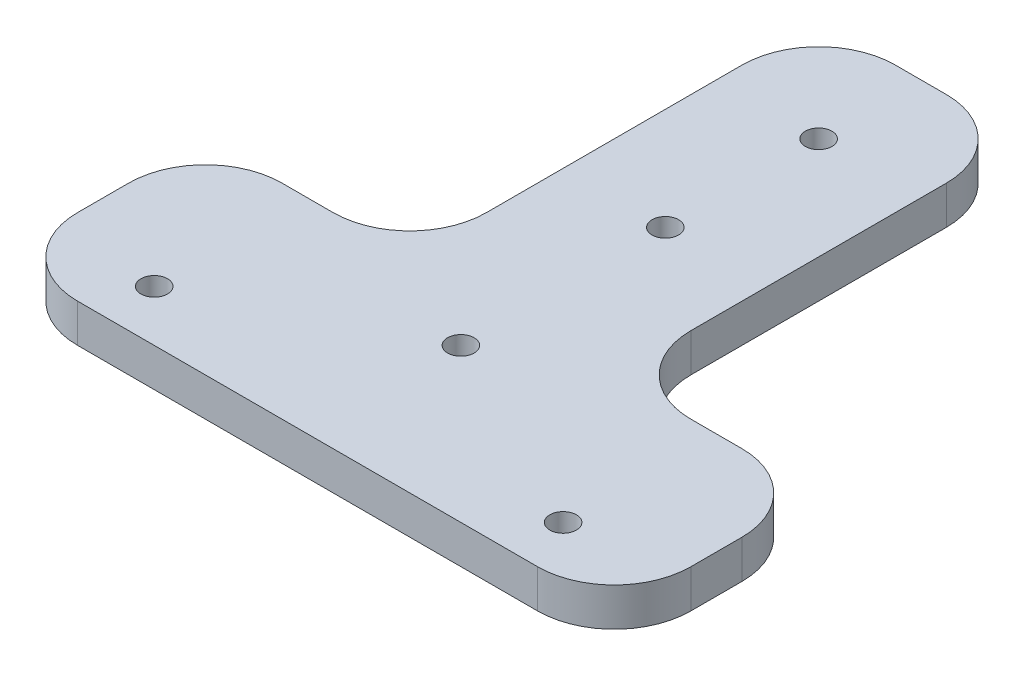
ISO-10303-21;
HEADER;
FILE_DESCRIPTION(('STEP AP214'),'2;1');
FILE_NAME('part.step','',(''),(''),'','','');
FILE_SCHEMA(('AUTOMOTIVE_DESIGN { 1 0 10303 214 1 1 1 1 }'));
ENDSEC;
DATA;
#1=APPLICATION_CONTEXT('core data for automotive mechanical design processes');
#2=APPLICATION_PROTOCOL_DEFINITION('international standard','automotive_design',2000,#1);
#3=PRODUCT_CONTEXT('',#1,'mechanical');
#4=PRODUCT('Part','Part','',(#3));
#5=PRODUCT_RELATED_PRODUCT_CATEGORY('part','',(#4));
#6=PRODUCT_DEFINITION_FORMATION('','',#4);
#7=PRODUCT_DEFINITION_CONTEXT('part definition',#1,'design');
#8=PRODUCT_DEFINITION('design','',#6,#7);
#9=PRODUCT_DEFINITION_SHAPE('','',#8);
#10=(LENGTH_UNIT() NAMED_UNIT(*) SI_UNIT(.MILLI.,.METRE.));
#11=(NAMED_UNIT(*) PLANE_ANGLE_UNIT() SI_UNIT($,.RADIAN.));
#12=(NAMED_UNIT(*) SI_UNIT($,.STERADIAN.) SOLID_ANGLE_UNIT());
#13=UNCERTAINTY_MEASURE_WITH_UNIT(LENGTH_MEASURE(1.E-05),#10,'distance_accuracy_value','');
#14=(GEOMETRIC_REPRESENTATION_CONTEXT(3) GLOBAL_UNCERTAINTY_ASSIGNED_CONTEXT((#13)) GLOBAL_UNIT_ASSIGNED_CONTEXT((#10,
#11,#12)) REPRESENTATION_CONTEXT('',''));
#15=CARTESIAN_POINT('',(0.,0.,0.));
#16=DIRECTION('',(0.,0.,1.));
#17=DIRECTION('',(1.,0.,0.));
#18=AXIS2_PLACEMENT_3D('',#15,#16,#17);
#19=CARTESIAN_POINT('',(0.,9.525,0.));
#20=DIRECTION('',(0.,0.,-1.));
#21=DIRECTION('',(-1.,0.,0.));
#22=AXIS2_PLACEMENT_3D('',#19,#20,#21);
#23=PLANE('',#22);
#24=DIRECTION('',(1.,0.,0.));
#25=VECTOR('',#24,1.);
#26=CARTESIAN_POINT('',(0.,0.,0.));
#27=LINE('',#26,#25);
#28=CARTESIAN_POINT('',(-57.15,0.,0.));
#29=VERTEX_POINT('',#28);
#30=CARTESIAN_POINT('',(57.15,0.,0.));
#31=VERTEX_POINT('',#30);
#32=EDGE_CURVE('E173',#29,#31,#27,.T.);
#33=ORIENTED_EDGE('',*,*,#32,.T.);
#34=DIRECTION('',(0.,-1.,0.));
#35=VECTOR('',#34,1.);
#36=CARTESIAN_POINT('',(57.15,9.525,0.));
#37=LINE('',#36,#35);
#38=CARTESIAN_POINT('',(57.15,9.525,0.));
#39=VERTEX_POINT('',#38);
#40=EDGE_CURVE('E151',#31,#39,#37,.F.);
#41=ORIENTED_EDGE('',*,*,#40,.T.);
#42=DIRECTION('',(1.,0.,0.));
#43=VECTOR('',#42,1.);
#44=CARTESIAN_POINT('',(0.,9.525,0.));
#45=LINE('',#44,#43);
#46=CARTESIAN_POINT('',(-57.15,9.525,0.));
#47=VERTEX_POINT('',#46);
#48=EDGE_CURVE('E195',#47,#39,#45,.T.);
#49=ORIENTED_EDGE('',*,*,#48,.F.);
#50=DIRECTION('',(0.,-1.,0.));
#51=VECTOR('',#50,1.);
#52=CARTESIAN_POINT('',(-57.15,9.525,0.));
#53=LINE('',#52,#51);
#54=EDGE_CURVE('E156',#47,#29,#53,.T.);
#55=ORIENTED_EDGE('',*,*,#54,.T.);
#56=EDGE_LOOP('',(#33,#41,#49,#55));
#57=FACE_BOUND('',#56,.T.);
#58=ADVANCED_FACE('F32',(#57),#23,.F.);
#59=CARTESIAN_POINT('',(76.2,9.525,-50.8));
#60=DIRECTION('',(-1.,0.,0.));
#61=DIRECTION('',(0.,0.,1.));
#62=AXIS2_PLACEMENT_3D('',#59,#60,#61);
#63=PLANE('',#62);
#64=DIRECTION('',(0.,0.,-1.));
#65=VECTOR('',#64,1.);
#66=CARTESIAN_POINT('',(76.2,9.525,-50.8));
#67=LINE('',#66,#65);
#68=CARTESIAN_POINT('',(76.2,9.525,-19.05));
#69=VERTEX_POINT('',#68);
#70=CARTESIAN_POINT('',(76.2,9.525,-31.75));
#71=VERTEX_POINT('',#70);
#72=EDGE_CURVE('E166',#69,#71,#67,.T.);
#73=ORIENTED_EDGE('',*,*,#72,.F.);
#74=DIRECTION('',(0.,-1.,0.));
#75=VECTOR('',#74,1.);
#76=CARTESIAN_POINT('',(76.2,9.525,-19.05));
#77=LINE('',#76,#75);
#78=CARTESIAN_POINT('',(76.2,0.,-19.05));
#79=VERTEX_POINT('',#78);
#80=EDGE_CURVE('E150',#69,#79,#77,.T.);
#81=ORIENTED_EDGE('',*,*,#80,.T.);
#82=DIRECTION('',(0.,0.,-1.));
#83=VECTOR('',#82,1.);
#84=CARTESIAN_POINT('',(76.2,0.,-50.8));
#85=LINE('',#84,#83);
#86=CARTESIAN_POINT('',(76.2,0.,-31.75));
#87=VERTEX_POINT('',#86);
#88=EDGE_CURVE('E163',#79,#87,#85,.T.);
#89=ORIENTED_EDGE('',*,*,#88,.T.);
#90=DIRECTION('',(0.,-1.,0.));
#91=VECTOR('',#90,1.);
#92=CARTESIAN_POINT('',(76.2,9.525,-31.75));
#93=LINE('',#92,#91);
#94=EDGE_CURVE('E168',#87,#71,#93,.F.);
#95=ORIENTED_EDGE('',*,*,#94,.T.);
#96=EDGE_LOOP('',(#73,#81,#89,#95));
#97=FACE_BOUND('',#96,.T.);
#98=ADVANCED_FACE('F162',(#97),#63,.F.);
#99=CARTESIAN_POINT('',(25.4,9.525,-50.8));
#100=DIRECTION('',(0.,0.,1.));
#101=DIRECTION('',(1.,0.,0.));
#102=AXIS2_PLACEMENT_3D('',#99,#100,#101);
#103=PLANE('',#102);
#104=DIRECTION('',(-1.,0.,0.));
#105=VECTOR('',#104,1.);
#106=CARTESIAN_POINT('',(25.4,9.525,-50.8));
#107=LINE('',#106,#105);
#108=CARTESIAN_POINT('',(57.15,9.525,-50.8));
#109=VERTEX_POINT('',#108);
#110=CARTESIAN_POINT('',(44.45,9.525,-50.8));
#111=VERTEX_POINT('',#110);
#112=EDGE_CURVE('E281',#109,#111,#107,.T.);
#113=ORIENTED_EDGE('',*,*,#112,.F.);
#114=DIRECTION('',(0.,-1.,0.));
#115=VECTOR('',#114,1.);
#116=CARTESIAN_POINT('',(57.15,9.525,-50.8));
#117=LINE('',#116,#115);
#118=CARTESIAN_POINT('',(57.15,0.,-50.8));
#119=VERTEX_POINT('',#118);
#120=EDGE_CURVE('E222',#109,#119,#117,.T.);
#121=ORIENTED_EDGE('',*,*,#120,.T.);
#122=DIRECTION('',(-1.,0.,0.));
#123=VECTOR('',#122,1.);
#124=CARTESIAN_POINT('',(25.4,0.,-50.8));
#125=LINE('',#124,#123);
#126=CARTESIAN_POINT('',(44.45,0.,-50.8));
#127=VERTEX_POINT('',#126);
#128=EDGE_CURVE('E172',#119,#127,#125,.T.);
#129=ORIENTED_EDGE('',*,*,#128,.T.);
#130=DIRECTION('',(0.,-1.,0.));
#131=VECTOR('',#130,1.);
#132=CARTESIAN_POINT('',(44.45,9.525,-50.8));
#133=LINE('',#132,#131);
#134=EDGE_CURVE('E220',#127,#111,#133,.F.);
#135=ORIENTED_EDGE('',*,*,#134,.T.);
#136=EDGE_LOOP('',(#113,#121,#129,#135));
#137=FACE_BOUND('',#136,.T.);
#138=ADVANCED_FACE('F357',(#137),#103,.F.);
#139=CARTESIAN_POINT('',(25.4,9.525,-152.4));
#140=DIRECTION('',(-1.,0.,0.));
#141=DIRECTION('',(0.,0.,1.));
#142=AXIS2_PLACEMENT_3D('',#139,#140,#141);
#143=PLANE('',#142);
#144=DIRECTION('',(0.,0.,-1.));
#145=VECTOR('',#144,1.);
#146=CARTESIAN_POINT('',(25.4,9.525,-152.4));
#147=LINE('',#146,#145);
#148=CARTESIAN_POINT('',(25.4,9.525,-69.85));
#149=VERTEX_POINT('',#148);
#150=CARTESIAN_POINT('',(25.4,9.525,-133.35));
#151=VERTEX_POINT('',#150);
#152=EDGE_CURVE('E278',#149,#151,#147,.T.);
#153=ORIENTED_EDGE('',*,*,#152,.F.);
#154=DIRECTION('',(0.,-1.,0.));
#155=VECTOR('',#154,1.);
#156=CARTESIAN_POINT('',(25.4,0.,-69.85));
#157=LINE('',#156,#155);
#158=CARTESIAN_POINT('',(25.4,0.,-69.85));
#159=VERTEX_POINT('',#158);
#160=EDGE_CURVE('E227',#149,#159,#157,.T.);
#161=ORIENTED_EDGE('',*,*,#160,.T.);
#162=DIRECTION('',(0.,0.,-1.));
#163=VECTOR('',#162,1.);
#164=CARTESIAN_POINT('',(25.4,0.,-152.4));
#165=LINE('',#164,#163);
#166=CARTESIAN_POINT('',(25.4,0.,-133.35));
#167=VERTEX_POINT('',#166);
#168=EDGE_CURVE('E176',#159,#167,#165,.T.);
#169=ORIENTED_EDGE('',*,*,#168,.T.);
#170=DIRECTION('',(0.,-1.,0.));
#171=VECTOR('',#170,1.);
#172=CARTESIAN_POINT('',(25.4,9.525,-133.35));
#173=LINE('',#172,#171);
#174=EDGE_CURVE('E225',#167,#151,#173,.F.);
#175=ORIENTED_EDGE('',*,*,#174,.T.);
#176=EDGE_LOOP('',(#153,#161,#169,#175));
#177=FACE_BOUND('',#176,.T.);
#178=ADVANCED_FACE('F399',(#177),#143,.F.);
#179=CARTESIAN_POINT('',(-25.4,9.525,-152.4));
#180=DIRECTION('',(0.,0.,1.));
#181=DIRECTION('',(1.,0.,0.));
#182=AXIS2_PLACEMENT_3D('',#179,#180,#181);
#183=PLANE('',#182);
#184=DIRECTION('',(-1.,0.,0.));
#185=VECTOR('',#184,1.);
#186=CARTESIAN_POINT('',(-25.4,9.525,-152.4));
#187=LINE('',#186,#185);
#188=CARTESIAN_POINT('',(6.34999999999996,9.525,-152.4));
#189=VERTEX_POINT('',#188);
#190=CARTESIAN_POINT('',(-6.35000000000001,9.525,-152.4));
#191=VERTEX_POINT('',#190);
#192=EDGE_CURVE('E273',#189,#191,#187,.T.);
#193=ORIENTED_EDGE('',*,*,#192,.F.);
#194=DIRECTION('',(0.,-1.,0.));
#195=VECTOR('',#194,1.);
#196=CARTESIAN_POINT('',(6.34999999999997,9.525,-152.4));
#197=LINE('',#196,#195);
#198=CARTESIAN_POINT('',(6.34999999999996,0.,-152.4));
#199=VERTEX_POINT('',#198);
#200=EDGE_CURVE('E246',#189,#199,#197,.T.);
#201=ORIENTED_EDGE('',*,*,#200,.T.);
#202=DIRECTION('',(-1.,0.,0.));
#203=VECTOR('',#202,1.);
#204=CARTESIAN_POINT('',(-25.4,0.,-152.4));
#205=LINE('',#204,#203);
#206=CARTESIAN_POINT('',(-6.35000000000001,0.,-152.4));
#207=VERTEX_POINT('',#206);
#208=EDGE_CURVE('E184',#199,#207,#205,.T.);
#209=ORIENTED_EDGE('',*,*,#208,.T.);
#210=DIRECTION('',(0.,-1.,0.));
#211=VECTOR('',#210,1.);
#212=CARTESIAN_POINT('',(-6.35,9.525,-152.4));
#213=LINE('',#212,#211);
#214=EDGE_CURVE('E244',#207,#191,#213,.F.);
#215=ORIENTED_EDGE('',*,*,#214,.T.);
#216=EDGE_LOOP('',(#193,#201,#209,#215));
#217=FACE_BOUND('',#216,.T.);
#218=ADVANCED_FACE('F394',(#217),#183,.F.);
#219=CARTESIAN_POINT('',(-25.4,9.525,-50.8));
#220=DIRECTION('',(1.,0.,0.));
#221=DIRECTION('',(0.,0.,-1.));
#222=AXIS2_PLACEMENT_3D('',#219,#220,#221);
#223=PLANE('',#222);
#224=DIRECTION('',(0.,0.,1.));
#225=VECTOR('',#224,1.);
#226=CARTESIAN_POINT('',(-25.4,0.,-50.8));
#227=LINE('',#226,#225);
#228=CARTESIAN_POINT('',(-25.4,0.,-133.35));
#229=VERTEX_POINT('',#228);
#230=CARTESIAN_POINT('',(-25.4,0.,-69.85));
#231=VERTEX_POINT('',#230);
#232=EDGE_CURVE('E187',#229,#231,#227,.T.);
#233=ORIENTED_EDGE('',*,*,#232,.T.);
#234=DIRECTION('',(0.,-1.,0.));
#235=VECTOR('',#234,1.);
#236=CARTESIAN_POINT('',(-25.4,9.525,-69.85));
#237=LINE('',#236,#235);
#238=CARTESIAN_POINT('',(-25.4,9.525,-69.85));
#239=VERTEX_POINT('',#238);
#240=EDGE_CURVE('E242',#231,#239,#237,.F.);
#241=ORIENTED_EDGE('',*,*,#240,.T.);
#242=DIRECTION('',(0.,0.,1.));
#243=VECTOR('',#242,1.);
#244=CARTESIAN_POINT('',(-25.4,9.525,-50.8));
#245=LINE('',#244,#243);
#246=CARTESIAN_POINT('',(-25.4,9.525,-133.35));
#247=VERTEX_POINT('',#246);
#248=EDGE_CURVE('E268',#247,#239,#245,.T.);
#249=ORIENTED_EDGE('',*,*,#248,.F.);
#250=DIRECTION('',(0.,-1.,0.));
#251=VECTOR('',#250,1.);
#252=CARTESIAN_POINT('',(-25.4,9.525,-133.35));
#253=LINE('',#252,#251);
#254=EDGE_CURVE('E239',#247,#229,#253,.T.);
#255=ORIENTED_EDGE('',*,*,#254,.T.);
#256=EDGE_LOOP('',(#233,#241,#249,#255));
#257=FACE_BOUND('',#256,.T.);
#258=ADVANCED_FACE('F258',(#257),#223,.F.);
#259=CARTESIAN_POINT('',(-76.2,9.525,-50.8));
#260=DIRECTION('',(0.,0.,1.));
#261=DIRECTION('',(1.,0.,0.));
#262=AXIS2_PLACEMENT_3D('',#259,#260,#261);
#263=PLANE('',#262);
#264=DIRECTION('',(-1.,0.,0.));
#265=VECTOR('',#264,1.);
#266=CARTESIAN_POINT('',(-76.2,0.,-50.8));
#267=LINE('',#266,#265);
#268=CARTESIAN_POINT('',(-44.45,0.,-50.8));
#269=VERTEX_POINT('',#268);
#270=CARTESIAN_POINT('',(-57.15,0.,-50.8));
#271=VERTEX_POINT('',#270);
#272=EDGE_CURVE('E190',#269,#271,#267,.T.);
#273=ORIENTED_EDGE('',*,*,#272,.T.);
#274=DIRECTION('',(0.,-1.,0.));
#275=VECTOR('',#274,1.);
#276=CARTESIAN_POINT('',(-57.15,9.525,-50.8));
#277=LINE('',#276,#275);
#278=CARTESIAN_POINT('',(-57.15,9.525,-50.8));
#279=VERTEX_POINT('',#278);
#280=EDGE_CURVE('E237',#271,#279,#277,.F.);
#281=ORIENTED_EDGE('',*,*,#280,.T.);
#282=DIRECTION('',(-1.,0.,0.));
#283=VECTOR('',#282,1.);
#284=CARTESIAN_POINT('',(-76.2,9.525,-50.8));
#285=LINE('',#284,#283);
#286=CARTESIAN_POINT('',(-44.45,9.525,-50.8));
#287=VERTEX_POINT('',#286);
#288=EDGE_CURVE('E267',#287,#279,#285,.T.);
#289=ORIENTED_EDGE('',*,*,#288,.F.);
#290=DIRECTION('',(0.,-1.,0.));
#291=VECTOR('',#290,1.);
#292=CARTESIAN_POINT('',(-44.45,0.,-50.8));
#293=LINE('',#292,#291);
#294=EDGE_CURVE('E234',#287,#269,#293,.T.);
#295=ORIENTED_EDGE('',*,*,#294,.T.);
#296=EDGE_LOOP('',(#273,#281,#289,#295));
#297=FACE_BOUND('',#296,.T.);
#298=ADVANCED_FACE('F270',(#297),#263,.F.);
#299=CARTESIAN_POINT('',(-76.2,9.525,0.));
#300=DIRECTION('',(1.,0.,0.));
#301=DIRECTION('',(0.,0.,-1.));
#302=AXIS2_PLACEMENT_3D('',#299,#300,#301);
#303=PLANE('',#302);
#304=DIRECTION('',(0.,0.,1.));
#305=VECTOR('',#304,1.);
#306=CARTESIAN_POINT('',(-76.2,0.,0.));
#307=LINE('',#306,#305);
#308=CARTESIAN_POINT('',(-76.2,0.,-31.75));
#309=VERTEX_POINT('',#308);
#310=CARTESIAN_POINT('',(-76.2,0.,-19.05));
#311=VERTEX_POINT('',#310);
#312=EDGE_CURVE('E193',#309,#311,#307,.T.);
#313=ORIENTED_EDGE('',*,*,#312,.T.);
#314=DIRECTION('',(0.,-1.,0.));
#315=VECTOR('',#314,1.);
#316=CARTESIAN_POINT('',(-76.2,9.525,-19.05));
#317=LINE('',#316,#315);
#318=CARTESIAN_POINT('',(-76.2,9.525,-19.05));
#319=VERTEX_POINT('',#318);
#320=EDGE_CURVE('E47',#311,#319,#317,.F.);
#321=ORIENTED_EDGE('',*,*,#320,.T.);
#322=DIRECTION('',(0.,0.,1.));
#323=VECTOR('',#322,1.);
#324=CARTESIAN_POINT('',(-76.2,9.525,0.));
#325=LINE('',#324,#323);
#326=CARTESIAN_POINT('',(-76.2,9.525,-31.75));
#327=VERTEX_POINT('',#326);
#328=EDGE_CURVE('E196',#327,#319,#325,.T.);
#329=ORIENTED_EDGE('',*,*,#328,.F.);
#330=DIRECTION('',(0.,-1.,0.));
#331=VECTOR('',#330,1.);
#332=CARTESIAN_POINT('',(-76.2,9.525,-31.75));
#333=LINE('',#332,#331);
#334=EDGE_CURVE('E230',#327,#309,#333,.T.);
#335=ORIENTED_EDGE('',*,*,#334,.T.);
#336=EDGE_LOOP('',(#313,#321,#329,#335));
#337=FACE_BOUND('',#336,.T.);
#338=ADVANCED_FACE('F327',(#337),#303,.F.);
#339=CARTESIAN_POINT('',(-76.2,9.525,0.));
#340=DIRECTION('',(0.,-1.,0.));
#341=DIRECTION('',(0.,0.,-1.));
#342=AXIS2_PLACEMENT_3D('',#339,#340,#341);
#343=PLANE('',#342);
#344=CARTESIAN_POINT('',(50.8,9.525,-12.7));
#345=DIRECTION('',(0.,1.,0.));
#346=DIRECTION('',(0.,0.,1.));
#347=AXIS2_PLACEMENT_3D('',#344,#345,#346);
#348=CIRCLE('',#347,3.302);
#349=CARTESIAN_POINT('',(50.8,9.525,-9.39799999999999));
#350=VERTEX_POINT('',#349);
#351=EDGE_CURVE('E310',#350,#350,#348,.T.);
#352=ORIENTED_EDGE('',*,*,#351,.F.);
#353=EDGE_LOOP('',(#352));
#354=FACE_BOUND('',#353,.T.);
#355=CARTESIAN_POINT('',(0.,9.525,-38.1));
#356=DIRECTION('',(0.,1.,0.));
#357=DIRECTION('',(0.,0.,1.));
#358=AXIS2_PLACEMENT_3D('',#355,#356,#357);
#359=CIRCLE('',#358,3.302);
#360=CARTESIAN_POINT('',(0.,9.525,-34.798));
#361=VERTEX_POINT('',#360);
#362=EDGE_CURVE('E304',#361,#361,#359,.T.);
#363=ORIENTED_EDGE('',*,*,#362,.F.);
#364=EDGE_LOOP('',(#363));
#365=FACE_BOUND('',#364,.T.);
#366=CARTESIAN_POINT('',(-50.8,9.525,-12.7));
#367=DIRECTION('',(0.,1.,0.));
#368=DIRECTION('',(0.,0.,1.));
#369=AXIS2_PLACEMENT_3D('',#366,#367,#368);
#370=CIRCLE('',#369,3.302);
#371=CARTESIAN_POINT('',(-50.8,9.525,-9.39799999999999));
#372=VERTEX_POINT('',#371);
#373=EDGE_CURVE('E298',#372,#372,#370,.T.);
#374=ORIENTED_EDGE('',*,*,#373,.F.);
#375=EDGE_LOOP('',(#374));
#376=FACE_BOUND('',#375,.T.);
#377=CARTESIAN_POINT('',(0.,9.525,-88.9));
#378=DIRECTION('',(0.,1.,0.));
#379=DIRECTION('',(0.,0.,1.));
#380=AXIS2_PLACEMENT_3D('',#377,#378,#379);
#381=CIRCLE('',#380,3.30199999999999);
#382=CARTESIAN_POINT('',(0.,9.525,-85.598));
#383=VERTEX_POINT('',#382);
#384=EDGE_CURVE('E292',#383,#383,#381,.T.);
#385=ORIENTED_EDGE('',*,*,#384,.F.);
#386=EDGE_LOOP('',(#385));
#387=FACE_BOUND('',#386,.T.);
#388=CARTESIAN_POINT('',(0.,9.525,-127.));
#389=DIRECTION('',(0.,1.,0.));
#390=DIRECTION('',(0.,0.,1.));
#391=AXIS2_PLACEMENT_3D('',#388,#389,#390);
#392=CIRCLE('',#391,3.30199999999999);
#393=CARTESIAN_POINT('',(0.,9.525,-123.698));
#394=VERTEX_POINT('',#393);
#395=EDGE_CURVE('E286',#394,#394,#392,.T.);
#396=ORIENTED_EDGE('',*,*,#395,.F.);
#397=EDGE_LOOP('',(#396));
#398=FACE_BOUND('',#397,.T.);
#399=ORIENTED_EDGE('',*,*,#48,.T.);
#400=CARTESIAN_POINT('',(57.15,9.525,-19.05));
#401=DIRECTION('',(0.,-1.,0.));
#402=DIRECTION('',(0.,0.,-1.));
#403=AXIS2_PLACEMENT_3D('',#400,#401,#402);
#404=CIRCLE('',#403,19.05);
#405=EDGE_CURVE('E218',#39,#69,#404,.F.);
#406=ORIENTED_EDGE('',*,*,#405,.T.);
#407=ORIENTED_EDGE('',*,*,#72,.T.);
#408=CARTESIAN_POINT('',(57.15,9.525,-31.75));
#409=DIRECTION('',(0.,-1.,0.));
#410=DIRECTION('',(0.,0.,-1.));
#411=AXIS2_PLACEMENT_3D('',#408,#409,#410);
#412=CIRCLE('',#411,19.05);
#413=EDGE_CURVE('E216',#71,#109,#412,.F.);
#414=ORIENTED_EDGE('',*,*,#413,.T.);
#415=ORIENTED_EDGE('',*,*,#112,.T.);
#416=CARTESIAN_POINT('',(44.45,9.525,-69.85));
#417=DIRECTION('',(0.,-1.,0.));
#418=DIRECTION('',(0.,0.,-1.));
#419=AXIS2_PLACEMENT_3D('',#416,#417,#418);
#420=CIRCLE('',#419,19.05);
#421=EDGE_CURVE('E251',#111,#149,#420,.T.);
#422=ORIENTED_EDGE('',*,*,#421,.T.);
#423=ORIENTED_EDGE('',*,*,#152,.T.);
#424=CARTESIAN_POINT('',(6.34999999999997,9.525,-133.35));
#425=DIRECTION('',(0.,-1.,0.));
#426=DIRECTION('',(0.,0.,-1.));
#427=AXIS2_PLACEMENT_3D('',#424,#425,#426);
#428=CIRCLE('',#427,19.05);
#429=EDGE_CURVE('E211',#151,#189,#428,.F.);
#430=ORIENTED_EDGE('',*,*,#429,.T.);
#431=ORIENTED_EDGE('',*,*,#192,.T.);
#432=CARTESIAN_POINT('',(-6.35,9.525,-133.35));
#433=DIRECTION('',(0.,-1.,0.));
#434=DIRECTION('',(0.,0.,-1.));
#435=AXIS2_PLACEMENT_3D('',#432,#433,#434);
#436=CIRCLE('',#435,19.05);
#437=EDGE_CURVE('E209',#191,#247,#436,.F.);
#438=ORIENTED_EDGE('',*,*,#437,.T.);
#439=ORIENTED_EDGE('',*,*,#248,.T.);
#440=CARTESIAN_POINT('',(-44.45,9.525,-69.85));
#441=DIRECTION('',(0.,-1.,0.));
#442=DIRECTION('',(0.,0.,-1.));
#443=AXIS2_PLACEMENT_3D('',#440,#441,#442);
#444=CIRCLE('',#443,19.05);
#445=EDGE_CURVE('E11',#239,#287,#444,.T.);
#446=ORIENTED_EDGE('',*,*,#445,.T.);
#447=ORIENTED_EDGE('',*,*,#288,.T.);
#448=CARTESIAN_POINT('',(-57.15,9.525,-31.75));
#449=DIRECTION('',(0.,-1.,0.));
#450=DIRECTION('',(0.,0.,-1.));
#451=AXIS2_PLACEMENT_3D('',#448,#449,#450);
#452=CIRCLE('',#451,19.05);
#453=EDGE_CURVE('E54',#279,#327,#452,.F.);
#454=ORIENTED_EDGE('',*,*,#453,.T.);
#455=ORIENTED_EDGE('',*,*,#328,.T.);
#456=CARTESIAN_POINT('',(-57.15,9.525,-19.05));
#457=DIRECTION('',(0.,-1.,0.));
#458=DIRECTION('',(0.,0.,-1.));
#459=AXIS2_PLACEMENT_3D('',#456,#457,#458);
#460=CIRCLE('',#459,19.05);
#461=EDGE_CURVE('E214',#319,#47,#460,.F.);
#462=ORIENTED_EDGE('',*,*,#461,.T.);
#463=EDGE_LOOP('',(#399,#406,#407,#414,#415,#422,#423,#430,#431,#438,#439,#446,#447,#454,#455,#462));
#464=FACE_BOUND('',#463,.T.);
#465=ADVANCED_FACE('F266',(#354,#365,#376,#387,#398,#464),#343,.F.);
#466=CARTESIAN_POINT('',(-76.2,0.,0.));
#467=DIRECTION('',(0.,-1.,0.));
#468=DIRECTION('',(0.,0.,-1.));
#469=AXIS2_PLACEMENT_3D('',#466,#467,#468);
#470=PLANE('',#469);
#471=CARTESIAN_POINT('',(50.8,0.,-12.7));
#472=DIRECTION('',(0.,1.,0.));
#473=DIRECTION('',(0.,0.,1.));
#474=AXIS2_PLACEMENT_3D('',#471,#472,#473);
#475=CIRCLE('',#474,3.302);
#476=CARTESIAN_POINT('',(50.8,0.,-9.39799999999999));
#477=VERTEX_POINT('',#476);
#478=EDGE_CURVE('E307',#477,#477,#475,.T.);
#479=ORIENTED_EDGE('',*,*,#478,.T.);
#480=EDGE_LOOP('',(#479));
#481=FACE_BOUND('',#480,.T.);
#482=CARTESIAN_POINT('',(0.,0.,-38.1));
#483=DIRECTION('',(0.,1.,0.));
#484=DIRECTION('',(0.,0.,1.));
#485=AXIS2_PLACEMENT_3D('',#482,#483,#484);
#486=CIRCLE('',#485,3.302);
#487=CARTESIAN_POINT('',(0.,0.,-34.798));
#488=VERTEX_POINT('',#487);
#489=EDGE_CURVE('E301',#488,#488,#486,.T.);
#490=ORIENTED_EDGE('',*,*,#489,.T.);
#491=EDGE_LOOP('',(#490));
#492=FACE_BOUND('',#491,.T.);
#493=CARTESIAN_POINT('',(-50.8,0.,-12.7));
#494=DIRECTION('',(0.,1.,0.));
#495=DIRECTION('',(0.,0.,1.));
#496=AXIS2_PLACEMENT_3D('',#493,#494,#495);
#497=CIRCLE('',#496,3.302);
#498=CARTESIAN_POINT('',(-50.8,0.,-9.39799999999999));
#499=VERTEX_POINT('',#498);
#500=EDGE_CURVE('E295',#499,#499,#497,.T.);
#501=ORIENTED_EDGE('',*,*,#500,.T.);
#502=EDGE_LOOP('',(#501));
#503=FACE_BOUND('',#502,.T.);
#504=CARTESIAN_POINT('',(0.,0.,-88.9));
#505=DIRECTION('',(0.,1.,0.));
#506=DIRECTION('',(0.,0.,1.));
#507=AXIS2_PLACEMENT_3D('',#504,#505,#506);
#508=CIRCLE('',#507,3.30199999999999);
#509=CARTESIAN_POINT('',(0.,0.,-85.598));
#510=VERTEX_POINT('',#509);
#511=EDGE_CURVE('E289',#510,#510,#508,.T.);
#512=ORIENTED_EDGE('',*,*,#511,.T.);
#513=EDGE_LOOP('',(#512));
#514=FACE_BOUND('',#513,.T.);
#515=CARTESIAN_POINT('',(0.,0.,-127.));
#516=DIRECTION('',(0.,1.,0.));
#517=DIRECTION('',(0.,0.,1.));
#518=AXIS2_PLACEMENT_3D('',#515,#516,#517);
#519=CIRCLE('',#518,3.30199999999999);
#520=CARTESIAN_POINT('',(0.,0.,-123.698));
#521=VERTEX_POINT('',#520);
#522=EDGE_CURVE('E178',#521,#521,#519,.T.);
#523=ORIENTED_EDGE('',*,*,#522,.T.);
#524=EDGE_LOOP('',(#523));
#525=FACE_BOUND('',#524,.T.);
#526=ORIENTED_EDGE('',*,*,#88,.F.);
#527=CARTESIAN_POINT('',(57.15,0.,-19.05));
#528=DIRECTION('',(0.,-1.,0.));
#529=DIRECTION('',(0.,0.,-1.));
#530=AXIS2_PLACEMENT_3D('',#527,#528,#529);
#531=CIRCLE('',#530,19.05);
#532=EDGE_CURVE('E146',#79,#31,#531,.T.);
#533=ORIENTED_EDGE('',*,*,#532,.T.);
#534=ORIENTED_EDGE('',*,*,#32,.F.);
#535=CARTESIAN_POINT('',(-57.15,0.,-19.05));
#536=DIRECTION('',(0.,-1.,0.));
#537=DIRECTION('',(0.,0.,-1.));
#538=AXIS2_PLACEMENT_3D('',#535,#536,#537);
#539=CIRCLE('',#538,19.05);
#540=EDGE_CURVE('E203',#29,#311,#539,.T.);
#541=ORIENTED_EDGE('',*,*,#540,.T.);
#542=ORIENTED_EDGE('',*,*,#312,.F.);
#543=CARTESIAN_POINT('',(-57.15,0.,-31.75));
#544=DIRECTION('',(0.,-1.,0.));
#545=DIRECTION('',(0.,0.,-1.));
#546=AXIS2_PLACEMENT_3D('',#543,#544,#545);
#547=CIRCLE('',#546,19.05);
#548=EDGE_CURVE('E201',#309,#271,#547,.T.);
#549=ORIENTED_EDGE('',*,*,#548,.T.);
#550=ORIENTED_EDGE('',*,*,#272,.F.);
#551=CARTESIAN_POINT('',(-44.45,0.,-69.85));
#552=DIRECTION('',(0.,-1.,0.));
#553=DIRECTION('',(0.,0.,-1.));
#554=AXIS2_PLACEMENT_3D('',#551,#552,#553);
#555=CIRCLE('',#554,19.05);
#556=EDGE_CURVE('E40',#269,#231,#555,.F.);
#557=ORIENTED_EDGE('',*,*,#556,.T.);
#558=ORIENTED_EDGE('',*,*,#232,.F.);
#559=CARTESIAN_POINT('',(-6.35,0.,-133.35));
#560=DIRECTION('',(0.,-1.,0.));
#561=DIRECTION('',(0.,0.,-1.));
#562=AXIS2_PLACEMENT_3D('',#559,#560,#561);
#563=CIRCLE('',#562,19.05);
#564=EDGE_CURVE('E167',#229,#207,#563,.T.);
#565=ORIENTED_EDGE('',*,*,#564,.T.);
#566=ORIENTED_EDGE('',*,*,#208,.F.);
#567=CARTESIAN_POINT('',(6.34999999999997,0.,-133.35));
#568=DIRECTION('',(0.,-1.,0.));
#569=DIRECTION('',(0.,0.,-1.));
#570=AXIS2_PLACEMENT_3D('',#567,#568,#569);
#571=CIRCLE('',#570,19.05);
#572=EDGE_CURVE('E199',#199,#167,#571,.T.);
#573=ORIENTED_EDGE('',*,*,#572,.T.);
#574=ORIENTED_EDGE('',*,*,#168,.F.);
#575=CARTESIAN_POINT('',(44.45,0.,-69.85));
#576=DIRECTION('',(0.,-1.,0.));
#577=DIRECTION('',(0.,0.,-1.));
#578=AXIS2_PLACEMENT_3D('',#575,#576,#577);
#579=CIRCLE('',#578,19.05);
#580=EDGE_CURVE('E249',#159,#127,#579,.F.);
#581=ORIENTED_EDGE('',*,*,#580,.T.);
#582=ORIENTED_EDGE('',*,*,#128,.F.);
#583=CARTESIAN_POINT('',(57.15,0.,-31.75));
#584=DIRECTION('',(0.,-1.,0.));
#585=DIRECTION('',(0.,0.,-1.));
#586=AXIS2_PLACEMENT_3D('',#583,#584,#585);
#587=CIRCLE('',#586,19.05);
#588=EDGE_CURVE('E157',#119,#87,#587,.T.);
#589=ORIENTED_EDGE('',*,*,#588,.T.);
#590=EDGE_LOOP('',(#526,#533,#534,#541,#542,#549,#550,#557,#558,#565,#566,#573,#574,#581,#582,#589));
#591=FACE_BOUND('',#590,.T.);
#592=ADVANCED_FACE('F170',(#481,#492,#503,#514,#525,#591),#470,.T.);
#593=CARTESIAN_POINT('',(0.,0.,-127.));
#594=DIRECTION('',(0.,1.,0.));
#595=DIRECTION('',(0.,0.,1.));
#596=AXIS2_PLACEMENT_3D('',#593,#594,#595);
#597=CYLINDRICAL_SURFACE('',#596,3.30199999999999);
#598=CARTESIAN_POINT('',(0.,0.,-123.698));
#599=CARTESIAN_POINT('',(0.,0.0992187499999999,-123.698));
#600=CARTESIAN_POINT('',(0.,0.1984375,-123.698));
#601=CARTESIAN_POINT('',(0.,0.396875,-123.698));
#602=CARTESIAN_POINT('',(0.,0.49609375,-123.698));
#603=CARTESIAN_POINT('',(0.,0.69453125,-123.698));
#604=CARTESIAN_POINT('',(0.,0.79375,-123.698));
#605=CARTESIAN_POINT('',(0.,0.9921875,-123.698));
#606=CARTESIAN_POINT('',(0.,1.09140625,-123.698));
#607=CARTESIAN_POINT('',(0.,1.28984375,-123.698));
#608=CARTESIAN_POINT('',(0.,1.3890625,-123.698));
#609=CARTESIAN_POINT('',(0.,1.5875,-123.698));
#610=CARTESIAN_POINT('',(0.,1.68671875,-123.698));
#611=CARTESIAN_POINT('',(0.,1.88515625,-123.698));
#612=CARTESIAN_POINT('',(0.,1.984375,-123.698));
#613=CARTESIAN_POINT('',(0.,2.1828125,-123.698));
#614=CARTESIAN_POINT('',(0.,2.28203125,-123.698));
#615=CARTESIAN_POINT('',(0.,2.48046875,-123.698));
#616=CARTESIAN_POINT('',(0.,2.5796875,-123.698));
#617=CARTESIAN_POINT('',(0.,2.778125,-123.698));
#618=CARTESIAN_POINT('',(0.,2.87734375,-123.698));
#619=CARTESIAN_POINT('',(0.,3.07578125,-123.698));
#620=CARTESIAN_POINT('',(0.,3.175,-123.698));
#621=CARTESIAN_POINT('',(0.,3.3734375,-123.698));
#622=CARTESIAN_POINT('',(0.,3.47265625,-123.698));
#623=CARTESIAN_POINT('',(0.,3.67109375,-123.698));
#624=CARTESIAN_POINT('',(0.,3.7703125,-123.698));
#625=CARTESIAN_POINT('',(0.,3.96875,-123.698));
#626=CARTESIAN_POINT('',(0.,4.06796875,-123.698));
#627=CARTESIAN_POINT('',(0.,4.26640625,-123.698));
#628=CARTESIAN_POINT('',(0.,4.365625,-123.698));
#629=CARTESIAN_POINT('',(0.,4.5640625,-123.698));
#630=CARTESIAN_POINT('',(0.,4.66328125,-123.698));
#631=CARTESIAN_POINT('',(0.,4.86171875,-123.698));
#632=CARTESIAN_POINT('',(0.,4.9609375,-123.698));
#633=CARTESIAN_POINT('',(0.,5.159375,-123.698));
#634=CARTESIAN_POINT('',(0.,5.25859375,-123.698));
#635=CARTESIAN_POINT('',(0.,5.45703125,-123.698));
#636=CARTESIAN_POINT('',(0.,5.55625,-123.698));
#637=CARTESIAN_POINT('',(0.,5.7546875,-123.698));
#638=CARTESIAN_POINT('',(0.,5.85390625,-123.698));
#639=CARTESIAN_POINT('',(0.,6.05234375,-123.698));
#640=CARTESIAN_POINT('',(0.,6.1515625,-123.698));
#641=CARTESIAN_POINT('',(0.,6.35,-123.698));
#642=CARTESIAN_POINT('',(0.,6.44921875,-123.698));
#643=CARTESIAN_POINT('',(0.,6.64765625,-123.698));
#644=CARTESIAN_POINT('',(0.,6.746875,-123.698));
#645=CARTESIAN_POINT('',(0.,6.9453125,-123.698));
#646=CARTESIAN_POINT('',(0.,7.04453125,-123.698));
#647=CARTESIAN_POINT('',(0.,7.24296875,-123.698));
#648=CARTESIAN_POINT('',(0.,7.3421875,-123.698));
#649=CARTESIAN_POINT('',(0.,7.540625,-123.698));
#650=CARTESIAN_POINT('',(0.,7.63984375,-123.698));
#651=CARTESIAN_POINT('',(0.,7.83828125,-123.698));
#652=CARTESIAN_POINT('',(0.,7.9375,-123.698));
#653=CARTESIAN_POINT('',(0.,8.1359375,-123.698));
#654=CARTESIAN_POINT('',(0.,8.23515625,-123.698));
#655=CARTESIAN_POINT('',(0.,8.43359375,-123.698));
#656=CARTESIAN_POINT('',(0.,8.5328125,-123.698));
#657=CARTESIAN_POINT('',(0.,8.73125,-123.698));
#658=CARTESIAN_POINT('',(0.,8.83046875,-123.698));
#659=CARTESIAN_POINT('',(0.,9.02890625,-123.698));
#660=CARTESIAN_POINT('',(0.,9.128125,-123.698));
#661=CARTESIAN_POINT('',(0.,9.3265625,-123.698));
#662=CARTESIAN_POINT('',(0.,9.42578125,-123.698));
#663=CARTESIAN_POINT('',(0.,9.525,-123.698));
#664=B_SPLINE_CURVE_WITH_KNOTS('',3,(#598,#599,#600,#601,#602,#603,#604,#605,#606,#607,#608,
#609,#610,#611,#612,#613,#614,#615,#616,#617,#618,#619,#620,#621,#622,#623,#624,#625,#626,#627,
#628,#629,#630,#631,#632,#633,#634,#635,#636,#637,#638,#639,#640,#641,#642,#643,#644,#645,#646,
#647,#648,#649,#650,#651,#652,#653,#654,#655,#656,#657,#658,#659,#660,#661,#662,#663),
.UNSPECIFIED.,.F.,.F.,(4,2,2,2,2,2,2,2,2,2,2,2,2,2,2,2,2,2,2,2,2,2,2,2,2,2,2,2,2,2,2,2,4),(0.,
0.29765625,0.5953125,0.89296875,1.190625,1.48828125,1.7859375,2.08359375,2.38125,2.67890625,
2.9765625,3.27421875,3.571875,3.86953125,4.1671875,4.46484375,4.7625,5.06015625,5.3578125,
5.65546875,5.953125,6.25078125,6.5484375,6.84609375,7.14375,7.44140625,7.7390625,8.03671875,
8.334375,8.63203125,8.9296875,9.22734375,9.525),.UNSPECIFIED.);
#665=EDGE_CURVE('BSEAM337',#521,#394,#664,.T.);
#666=ORIENTED_EDGE('',*,*,#522,.F.);
#667=ORIENTED_EDGE('',*,*,#395,.T.);
#668=ORIENTED_EDGE('',*,*,#665,.T.);
#669=ORIENTED_EDGE('',*,*,#665,.F.);
#670=EDGE_LOOP('',(#666,#668,#667,#669));
#671=FACE_BOUND('',#670,.T.);
#672=ADVANCED_FACE('F337',(#671),#597,.F.);
#673=CARTESIAN_POINT('',(0.,0.,-88.9));
#674=DIRECTION('',(0.,1.,0.));
#675=DIRECTION('',(0.,0.,1.));
#676=AXIS2_PLACEMENT_3D('',#673,#674,#675);
#677=CYLINDRICAL_SURFACE('',#676,3.30199999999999);
#678=CARTESIAN_POINT('',(0.,0.,-85.598));
#679=CARTESIAN_POINT('',(0.,0.0992187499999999,-85.598));
#680=CARTESIAN_POINT('',(0.,0.1984375,-85.598));
#681=CARTESIAN_POINT('',(0.,0.396875,-85.598));
#682=CARTESIAN_POINT('',(0.,0.49609375,-85.598));
#683=CARTESIAN_POINT('',(0.,0.69453125,-85.598));
#684=CARTESIAN_POINT('',(0.,0.79375,-85.598));
#685=CARTESIAN_POINT('',(0.,0.9921875,-85.598));
#686=CARTESIAN_POINT('',(0.,1.09140625,-85.598));
#687=CARTESIAN_POINT('',(0.,1.28984375,-85.598));
#688=CARTESIAN_POINT('',(0.,1.3890625,-85.598));
#689=CARTESIAN_POINT('',(0.,1.5875,-85.598));
#690=CARTESIAN_POINT('',(0.,1.68671875,-85.598));
#691=CARTESIAN_POINT('',(0.,1.88515625,-85.598));
#692=CARTESIAN_POINT('',(0.,1.984375,-85.598));
#693=CARTESIAN_POINT('',(0.,2.1828125,-85.598));
#694=CARTESIAN_POINT('',(0.,2.28203125,-85.598));
#695=CARTESIAN_POINT('',(0.,2.48046875,-85.598));
#696=CARTESIAN_POINT('',(0.,2.5796875,-85.598));
#697=CARTESIAN_POINT('',(0.,2.778125,-85.598));
#698=CARTESIAN_POINT('',(0.,2.87734375,-85.598));
#699=CARTESIAN_POINT('',(0.,3.07578125,-85.598));
#700=CARTESIAN_POINT('',(0.,3.175,-85.598));
#701=CARTESIAN_POINT('',(0.,3.3734375,-85.598));
#702=CARTESIAN_POINT('',(0.,3.47265625,-85.598));
#703=CARTESIAN_POINT('',(0.,3.67109375,-85.598));
#704=CARTESIAN_POINT('',(0.,3.7703125,-85.598));
#705=CARTESIAN_POINT('',(0.,3.96875,-85.598));
#706=CARTESIAN_POINT('',(0.,4.06796875,-85.598));
#707=CARTESIAN_POINT('',(0.,4.26640625,-85.598));
#708=CARTESIAN_POINT('',(0.,4.365625,-85.598));
#709=CARTESIAN_POINT('',(0.,4.5640625,-85.598));
#710=CARTESIAN_POINT('',(0.,4.66328125,-85.598));
#711=CARTESIAN_POINT('',(0.,4.86171875,-85.598));
#712=CARTESIAN_POINT('',(0.,4.9609375,-85.598));
#713=CARTESIAN_POINT('',(0.,5.159375,-85.598));
#714=CARTESIAN_POINT('',(0.,5.25859375,-85.598));
#715=CARTESIAN_POINT('',(0.,5.45703125,-85.598));
#716=CARTESIAN_POINT('',(0.,5.55625,-85.598));
#717=CARTESIAN_POINT('',(0.,5.7546875,-85.598));
#718=CARTESIAN_POINT('',(0.,5.85390625,-85.598));
#719=CARTESIAN_POINT('',(0.,6.05234375,-85.598));
#720=CARTESIAN_POINT('',(0.,6.1515625,-85.598));
#721=CARTESIAN_POINT('',(0.,6.35,-85.598));
#722=CARTESIAN_POINT('',(0.,6.44921875,-85.598));
#723=CARTESIAN_POINT('',(0.,6.64765625,-85.598));
#724=CARTESIAN_POINT('',(0.,6.746875,-85.598));
#725=CARTESIAN_POINT('',(0.,6.9453125,-85.598));
#726=CARTESIAN_POINT('',(0.,7.04453125,-85.598));
#727=CARTESIAN_POINT('',(0.,7.24296875,-85.598));
#728=CARTESIAN_POINT('',(0.,7.3421875,-85.598));
#729=CARTESIAN_POINT('',(0.,7.540625,-85.598));
#730=CARTESIAN_POINT('',(0.,7.63984375,-85.598));
#731=CARTESIAN_POINT('',(0.,7.83828125,-85.598));
#732=CARTESIAN_POINT('',(0.,7.9375,-85.598));
#733=CARTESIAN_POINT('',(0.,8.1359375,-85.598));
#734=CARTESIAN_POINT('',(0.,8.23515625,-85.598));
#735=CARTESIAN_POINT('',(0.,8.43359375,-85.598));
#736=CARTESIAN_POINT('',(0.,8.5328125,-85.598));
#737=CARTESIAN_POINT('',(0.,8.73125,-85.598));
#738=CARTESIAN_POINT('',(0.,8.83046875,-85.598));
#739=CARTESIAN_POINT('',(0.,9.02890625,-85.598));
#740=CARTESIAN_POINT('',(0.,9.128125,-85.598));
#741=CARTESIAN_POINT('',(0.,9.3265625,-85.598));
#742=CARTESIAN_POINT('',(0.,9.42578125,-85.598));
#743=CARTESIAN_POINT('',(0.,9.525,-85.598));
#744=B_SPLINE_CURVE_WITH_KNOTS('',3,(#678,#679,#680,#681,#682,#683,#684,#685,#686,#687,#688,
#689,#690,#691,#692,#693,#694,#695,#696,#697,#698,#699,#700,#701,#702,#703,#704,#705,#706,#707,
#708,#709,#710,#711,#712,#713,#714,#715,#716,#717,#718,#719,#720,#721,#722,#723,#724,#725,#726,
#727,#728,#729,#730,#731,#732,#733,#734,#735,#736,#737,#738,#739,#740,#741,#742,#743),
.UNSPECIFIED.,.F.,.F.,(4,2,2,2,2,2,2,2,2,2,2,2,2,2,2,2,2,2,2,2,2,2,2,2,2,2,2,2,2,2,2,2,4),(0.,
0.29765625,0.5953125,0.89296875,1.190625,1.48828125,1.7859375,2.08359375,2.38125,2.67890625,
2.9765625,3.27421875,3.571875,3.86953125,4.1671875,4.46484375,4.7625,5.06015625,5.3578125,
5.65546875,5.953125,6.25078125,6.5484375,6.84609375,7.14375,7.44140625,7.7390625,8.03671875,
8.334375,8.63203125,8.9296875,9.22734375,9.525),.UNSPECIFIED.);
#745=EDGE_CURVE('BSEAM339',#510,#383,#744,.T.);
#746=ORIENTED_EDGE('',*,*,#511,.F.);
#747=ORIENTED_EDGE('',*,*,#384,.T.);
#748=ORIENTED_EDGE('',*,*,#745,.T.);
#749=ORIENTED_EDGE('',*,*,#745,.F.);
#750=EDGE_LOOP('',(#746,#748,#747,#749));
#751=FACE_BOUND('',#750,.T.);
#752=ADVANCED_FACE('F339',(#751),#677,.F.);
#753=CARTESIAN_POINT('',(-50.8,0.,-12.7));
#754=DIRECTION('',(0.,1.,0.));
#755=DIRECTION('',(0.,0.,1.));
#756=AXIS2_PLACEMENT_3D('',#753,#754,#755);
#757=CYLINDRICAL_SURFACE('',#756,3.302);
#758=CARTESIAN_POINT('',(-50.8,0.,-9.39799999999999));
#759=CARTESIAN_POINT('',(-50.8,0.0992187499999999,-9.39799999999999));
#760=CARTESIAN_POINT('',(-50.8,0.1984375,-9.39799999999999));
#761=CARTESIAN_POINT('',(-50.8,0.396875,-9.39799999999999));
#762=CARTESIAN_POINT('',(-50.8,0.49609375,-9.39799999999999));
#763=CARTESIAN_POINT('',(-50.8,0.69453125,-9.39799999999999));
#764=CARTESIAN_POINT('',(-50.8,0.79375,-9.39799999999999));
#765=CARTESIAN_POINT('',(-50.8,0.9921875,-9.39799999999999));
#766=CARTESIAN_POINT('',(-50.8,1.09140625,-9.39799999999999));
#767=CARTESIAN_POINT('',(-50.8,1.28984375,-9.39799999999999));
#768=CARTESIAN_POINT('',(-50.8,1.3890625,-9.39799999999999));
#769=CARTESIAN_POINT('',(-50.8,1.5875,-9.39799999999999));
#770=CARTESIAN_POINT('',(-50.8,1.68671875,-9.39799999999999));
#771=CARTESIAN_POINT('',(-50.8,1.88515625,-9.39799999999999));
#772=CARTESIAN_POINT('',(-50.8,1.984375,-9.39799999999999));
#773=CARTESIAN_POINT('',(-50.8,2.1828125,-9.39799999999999));
#774=CARTESIAN_POINT('',(-50.8,2.28203125,-9.39799999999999));
#775=CARTESIAN_POINT('',(-50.8,2.48046875,-9.39799999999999));
#776=CARTESIAN_POINT('',(-50.8,2.5796875,-9.39799999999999));
#777=CARTESIAN_POINT('',(-50.8,2.778125,-9.39799999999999));
#778=CARTESIAN_POINT('',(-50.8,2.87734375,-9.39799999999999));
#779=CARTESIAN_POINT('',(-50.8,3.07578125,-9.39799999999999));
#780=CARTESIAN_POINT('',(-50.8,3.175,-9.39799999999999));
#781=CARTESIAN_POINT('',(-50.8,3.3734375,-9.39799999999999));
#782=CARTESIAN_POINT('',(-50.8,3.47265625,-9.39799999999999));
#783=CARTESIAN_POINT('',(-50.8,3.67109375,-9.39799999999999));
#784=CARTESIAN_POINT('',(-50.8,3.7703125,-9.39799999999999));
#785=CARTESIAN_POINT('',(-50.8,3.96875,-9.39799999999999));
#786=CARTESIAN_POINT('',(-50.8,4.06796875,-9.39799999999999));
#787=CARTESIAN_POINT('',(-50.8,4.26640625,-9.39799999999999));
#788=CARTESIAN_POINT('',(-50.8,4.365625,-9.39799999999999));
#789=CARTESIAN_POINT('',(-50.8,4.5640625,-9.39799999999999));
#790=CARTESIAN_POINT('',(-50.8,4.66328125,-9.39799999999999));
#791=CARTESIAN_POINT('',(-50.8,4.86171875,-9.39799999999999));
#792=CARTESIAN_POINT('',(-50.8,4.9609375,-9.39799999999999));
#793=CARTESIAN_POINT('',(-50.8,5.159375,-9.39799999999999));
#794=CARTESIAN_POINT('',(-50.8,5.25859375,-9.39799999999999));
#795=CARTESIAN_POINT('',(-50.8,5.45703125,-9.39799999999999));
#796=CARTESIAN_POINT('',(-50.8,5.55625,-9.39799999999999));
#797=CARTESIAN_POINT('',(-50.8,5.7546875,-9.39799999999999));
#798=CARTESIAN_POINT('',(-50.8,5.85390625,-9.39799999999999));
#799=CARTESIAN_POINT('',(-50.8,6.05234375,-9.39799999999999));
#800=CARTESIAN_POINT('',(-50.8,6.1515625,-9.39799999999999));
#801=CARTESIAN_POINT('',(-50.8,6.35,-9.39799999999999));
#802=CARTESIAN_POINT('',(-50.8,6.44921875,-9.39799999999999));
#803=CARTESIAN_POINT('',(-50.8,6.64765625,-9.39799999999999));
#804=CARTESIAN_POINT('',(-50.8,6.746875,-9.39799999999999));
#805=CARTESIAN_POINT('',(-50.8,6.9453125,-9.39799999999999));
#806=CARTESIAN_POINT('',(-50.8,7.04453125,-9.39799999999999));
#807=CARTESIAN_POINT('',(-50.8,7.24296875,-9.39799999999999));
#808=CARTESIAN_POINT('',(-50.8,7.3421875,-9.39799999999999));
#809=CARTESIAN_POINT('',(-50.8,7.540625,-9.39799999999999));
#810=CARTESIAN_POINT('',(-50.8,7.63984375,-9.39799999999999));
#811=CARTESIAN_POINT('',(-50.8,7.83828125,-9.39799999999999));
#812=CARTESIAN_POINT('',(-50.8,7.9375,-9.39799999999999));
#813=CARTESIAN_POINT('',(-50.8,8.1359375,-9.39799999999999));
#814=CARTESIAN_POINT('',(-50.8,8.23515625,-9.39799999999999));
#815=CARTESIAN_POINT('',(-50.8,8.43359375,-9.39799999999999));
#816=CARTESIAN_POINT('',(-50.8,8.5328125,-9.39799999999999));
#817=CARTESIAN_POINT('',(-50.8,8.73125,-9.39799999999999));
#818=CARTESIAN_POINT('',(-50.8,8.83046875,-9.39799999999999));
#819=CARTESIAN_POINT('',(-50.8,9.02890625,-9.39799999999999));
#820=CARTESIAN_POINT('',(-50.8,9.128125,-9.39799999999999));
#821=CARTESIAN_POINT('',(-50.8,9.3265625,-9.39799999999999));
#822=CARTESIAN_POINT('',(-50.8,9.42578125,-9.39799999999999));
#823=CARTESIAN_POINT('',(-50.8,9.525,-9.39799999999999));
#824=B_SPLINE_CURVE_WITH_KNOTS('',3,(#758,#759,#760,#761,#762,#763,#764,#765,#766,#767,#768,
#769,#770,#771,#772,#773,#774,#775,#776,#777,#778,#779,#780,#781,#782,#783,#784,#785,#786,#787,
#788,#789,#790,#791,#792,#793,#794,#795,#796,#797,#798,#799,#800,#801,#802,#803,#804,#805,#806,
#807,#808,#809,#810,#811,#812,#813,#814,#815,#816,#817,#818,#819,#820,#821,#822,#823),
.UNSPECIFIED.,.F.,.F.,(4,2,2,2,2,2,2,2,2,2,2,2,2,2,2,2,2,2,2,2,2,2,2,2,2,2,2,2,2,2,2,2,4),(0.,
0.29765625,0.5953125,0.89296875,1.190625,1.48828125,1.7859375,2.08359375,2.38125,2.67890625,
2.9765625,3.27421875,3.571875,3.86953125,4.1671875,4.46484375,4.7625,5.06015625,5.3578125,
5.65546875,5.953125,6.25078125,6.5484375,6.84609375,7.14375,7.44140625,7.7390625,8.03671875,
8.334375,8.63203125,8.9296875,9.22734375,9.525),.UNSPECIFIED.);
#825=EDGE_CURVE('BSEAM346',#499,#372,#824,.T.);
#826=ORIENTED_EDGE('',*,*,#500,.F.);
#827=ORIENTED_EDGE('',*,*,#373,.T.);
#828=ORIENTED_EDGE('',*,*,#825,.T.);
#829=ORIENTED_EDGE('',*,*,#825,.F.);
#830=EDGE_LOOP('',(#826,#828,#827,#829));
#831=FACE_BOUND('',#830,.T.);
#832=ADVANCED_FACE('F346',(#831),#757,.F.);
#833=CARTESIAN_POINT('',(0.,0.,-38.1));
#834=DIRECTION('',(0.,1.,0.));
#835=DIRECTION('',(0.,0.,1.));
#836=AXIS2_PLACEMENT_3D('',#833,#834,#835);
#837=CYLINDRICAL_SURFACE('',#836,3.302);
#838=CARTESIAN_POINT('',(0.,0.,-34.798));
#839=CARTESIAN_POINT('',(0.,0.0992187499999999,-34.798));
#840=CARTESIAN_POINT('',(0.,0.1984375,-34.798));
#841=CARTESIAN_POINT('',(0.,0.396875,-34.798));
#842=CARTESIAN_POINT('',(0.,0.49609375,-34.798));
#843=CARTESIAN_POINT('',(0.,0.69453125,-34.798));
#844=CARTESIAN_POINT('',(0.,0.79375,-34.798));
#845=CARTESIAN_POINT('',(0.,0.9921875,-34.798));
#846=CARTESIAN_POINT('',(0.,1.09140625,-34.798));
#847=CARTESIAN_POINT('',(0.,1.28984375,-34.798));
#848=CARTESIAN_POINT('',(0.,1.3890625,-34.798));
#849=CARTESIAN_POINT('',(0.,1.5875,-34.798));
#850=CARTESIAN_POINT('',(0.,1.68671875,-34.798));
#851=CARTESIAN_POINT('',(0.,1.88515625,-34.798));
#852=CARTESIAN_POINT('',(0.,1.984375,-34.798));
#853=CARTESIAN_POINT('',(0.,2.1828125,-34.798));
#854=CARTESIAN_POINT('',(0.,2.28203125,-34.798));
#855=CARTESIAN_POINT('',(0.,2.48046875,-34.798));
#856=CARTESIAN_POINT('',(0.,2.5796875,-34.798));
#857=CARTESIAN_POINT('',(0.,2.778125,-34.798));
#858=CARTESIAN_POINT('',(0.,2.87734375,-34.798));
#859=CARTESIAN_POINT('',(0.,3.07578125,-34.798));
#860=CARTESIAN_POINT('',(0.,3.175,-34.798));
#861=CARTESIAN_POINT('',(0.,3.3734375,-34.798));
#862=CARTESIAN_POINT('',(0.,3.47265625,-34.798));
#863=CARTESIAN_POINT('',(0.,3.67109375,-34.798));
#864=CARTESIAN_POINT('',(0.,3.7703125,-34.798));
#865=CARTESIAN_POINT('',(0.,3.96875,-34.798));
#866=CARTESIAN_POINT('',(0.,4.06796875,-34.798));
#867=CARTESIAN_POINT('',(0.,4.26640625,-34.798));
#868=CARTESIAN_POINT('',(0.,4.365625,-34.798));
#869=CARTESIAN_POINT('',(0.,4.5640625,-34.798));
#870=CARTESIAN_POINT('',(0.,4.66328125,-34.798));
#871=CARTESIAN_POINT('',(0.,4.86171875,-34.798));
#872=CARTESIAN_POINT('',(0.,4.9609375,-34.798));
#873=CARTESIAN_POINT('',(0.,5.159375,-34.798));
#874=CARTESIAN_POINT('',(0.,5.25859375,-34.798));
#875=CARTESIAN_POINT('',(0.,5.45703125,-34.798));
#876=CARTESIAN_POINT('',(0.,5.55625,-34.798));
#877=CARTESIAN_POINT('',(0.,5.7546875,-34.798));
#878=CARTESIAN_POINT('',(0.,5.85390625,-34.798));
#879=CARTESIAN_POINT('',(0.,6.05234375,-34.798));
#880=CARTESIAN_POINT('',(0.,6.1515625,-34.798));
#881=CARTESIAN_POINT('',(0.,6.35,-34.798));
#882=CARTESIAN_POINT('',(0.,6.44921875,-34.798));
#883=CARTESIAN_POINT('',(0.,6.64765625,-34.798));
#884=CARTESIAN_POINT('',(0.,6.746875,-34.798));
#885=CARTESIAN_POINT('',(0.,6.9453125,-34.798));
#886=CARTESIAN_POINT('',(0.,7.04453125,-34.798));
#887=CARTESIAN_POINT('',(0.,7.24296875,-34.798));
#888=CARTESIAN_POINT('',(0.,7.3421875,-34.798));
#889=CARTESIAN_POINT('',(0.,7.540625,-34.798));
#890=CARTESIAN_POINT('',(0.,7.63984375,-34.798));
#891=CARTESIAN_POINT('',(0.,7.83828125,-34.798));
#892=CARTESIAN_POINT('',(0.,7.9375,-34.798));
#893=CARTESIAN_POINT('',(0.,8.1359375,-34.798));
#894=CARTESIAN_POINT('',(0.,8.23515625,-34.798));
#895=CARTESIAN_POINT('',(0.,8.43359375,-34.798));
#896=CARTESIAN_POINT('',(0.,8.5328125,-34.798));
#897=CARTESIAN_POINT('',(0.,8.73125,-34.798));
#898=CARTESIAN_POINT('',(0.,8.83046875,-34.798));
#899=CARTESIAN_POINT('',(0.,9.02890625,-34.798));
#900=CARTESIAN_POINT('',(0.,9.128125,-34.798));
#901=CARTESIAN_POINT('',(0.,9.3265625,-34.798));
#902=CARTESIAN_POINT('',(0.,9.42578125,-34.798));
#903=CARTESIAN_POINT('',(0.,9.525,-34.798));
#904=B_SPLINE_CURVE_WITH_KNOTS('',3,(#838,#839,#840,#841,#842,#843,#844,#845,#846,#847,#848,
#849,#850,#851,#852,#853,#854,#855,#856,#857,#858,#859,#860,#861,#862,#863,#864,#865,#866,#867,
#868,#869,#870,#871,#872,#873,#874,#875,#876,#877,#878,#879,#880,#881,#882,#883,#884,#885,#886,
#887,#888,#889,#890,#891,#892,#893,#894,#895,#896,#897,#898,#899,#900,#901,#902,#903),
.UNSPECIFIED.,.F.,.F.,(4,2,2,2,2,2,2,2,2,2,2,2,2,2,2,2,2,2,2,2,2,2,2,2,2,2,2,2,2,2,2,2,4),(0.,
0.29765625,0.5953125,0.89296875,1.190625,1.48828125,1.7859375,2.08359375,2.38125,2.67890625,
2.9765625,3.27421875,3.571875,3.86953125,4.1671875,4.46484375,4.7625,5.06015625,5.3578125,
5.65546875,5.953125,6.25078125,6.5484375,6.84609375,7.14375,7.44140625,7.7390625,8.03671875,
8.334375,8.63203125,8.9296875,9.22734375,9.525),.UNSPECIFIED.);
#905=EDGE_CURVE('BSEAM321',#488,#361,#904,.T.);
#906=ORIENTED_EDGE('',*,*,#489,.F.);
#907=ORIENTED_EDGE('',*,*,#362,.T.);
#908=ORIENTED_EDGE('',*,*,#905,.T.);
#909=ORIENTED_EDGE('',*,*,#905,.F.);
#910=EDGE_LOOP('',(#906,#908,#907,#909));
#911=FACE_BOUND('',#910,.T.);
#912=ADVANCED_FACE('F321',(#911),#837,.F.);
#913=CARTESIAN_POINT('',(50.8,0.,-12.7));
#914=DIRECTION('',(0.,1.,0.));
#915=DIRECTION('',(0.,0.,1.));
#916=AXIS2_PLACEMENT_3D('',#913,#914,#915);
#917=CYLINDRICAL_SURFACE('',#916,3.302);
#918=CARTESIAN_POINT('',(50.8,0.,-9.39799999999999));
#919=CARTESIAN_POINT('',(50.8,0.0992187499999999,-9.39799999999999));
#920=CARTESIAN_POINT('',(50.8,0.1984375,-9.39799999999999));
#921=CARTESIAN_POINT('',(50.8,0.396875,-9.39799999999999));
#922=CARTESIAN_POINT('',(50.8,0.49609375,-9.39799999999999));
#923=CARTESIAN_POINT('',(50.8,0.69453125,-9.39799999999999));
#924=CARTESIAN_POINT('',(50.8,0.79375,-9.39799999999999));
#925=CARTESIAN_POINT('',(50.8,0.9921875,-9.39799999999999));
#926=CARTESIAN_POINT('',(50.8,1.09140625,-9.39799999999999));
#927=CARTESIAN_POINT('',(50.8,1.28984375,-9.39799999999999));
#928=CARTESIAN_POINT('',(50.8,1.3890625,-9.39799999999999));
#929=CARTESIAN_POINT('',(50.8,1.5875,-9.39799999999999));
#930=CARTESIAN_POINT('',(50.8,1.68671875,-9.39799999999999));
#931=CARTESIAN_POINT('',(50.8,1.88515625,-9.39799999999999));
#932=CARTESIAN_POINT('',(50.8,1.984375,-9.39799999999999));
#933=CARTESIAN_POINT('',(50.8,2.1828125,-9.39799999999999));
#934=CARTESIAN_POINT('',(50.8,2.28203125,-9.39799999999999));
#935=CARTESIAN_POINT('',(50.8,2.48046875,-9.39799999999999));
#936=CARTESIAN_POINT('',(50.8,2.5796875,-9.39799999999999));
#937=CARTESIAN_POINT('',(50.8,2.778125,-9.39799999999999));
#938=CARTESIAN_POINT('',(50.8,2.87734375,-9.39799999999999));
#939=CARTESIAN_POINT('',(50.8,3.07578125,-9.39799999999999));
#940=CARTESIAN_POINT('',(50.8,3.175,-9.39799999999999));
#941=CARTESIAN_POINT('',(50.8,3.3734375,-9.39799999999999));
#942=CARTESIAN_POINT('',(50.8,3.47265625,-9.39799999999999));
#943=CARTESIAN_POINT('',(50.8,3.67109375,-9.39799999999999));
#944=CARTESIAN_POINT('',(50.8,3.7703125,-9.39799999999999));
#945=CARTESIAN_POINT('',(50.8,3.96875,-9.39799999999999));
#946=CARTESIAN_POINT('',(50.8,4.06796875,-9.39799999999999));
#947=CARTESIAN_POINT('',(50.8,4.26640625,-9.39799999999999));
#948=CARTESIAN_POINT('',(50.8,4.365625,-9.39799999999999));
#949=CARTESIAN_POINT('',(50.8,4.5640625,-9.39799999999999));
#950=CARTESIAN_POINT('',(50.8,4.66328125,-9.39799999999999));
#951=CARTESIAN_POINT('',(50.8,4.86171875,-9.39799999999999));
#952=CARTESIAN_POINT('',(50.8,4.9609375,-9.39799999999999));
#953=CARTESIAN_POINT('',(50.8,5.159375,-9.39799999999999));
#954=CARTESIAN_POINT('',(50.8,5.25859375,-9.39799999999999));
#955=CARTESIAN_POINT('',(50.8,5.45703125,-9.39799999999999));
#956=CARTESIAN_POINT('',(50.8,5.55625,-9.39799999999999));
#957=CARTESIAN_POINT('',(50.8,5.7546875,-9.39799999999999));
#958=CARTESIAN_POINT('',(50.8,5.85390625,-9.39799999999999));
#959=CARTESIAN_POINT('',(50.8,6.05234375,-9.39799999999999));
#960=CARTESIAN_POINT('',(50.8,6.1515625,-9.39799999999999));
#961=CARTESIAN_POINT('',(50.8,6.35,-9.39799999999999));
#962=CARTESIAN_POINT('',(50.8,6.44921875,-9.39799999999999));
#963=CARTESIAN_POINT('',(50.8,6.64765625,-9.39799999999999));
#964=CARTESIAN_POINT('',(50.8,6.746875,-9.39799999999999));
#965=CARTESIAN_POINT('',(50.8,6.9453125,-9.39799999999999));
#966=CARTESIAN_POINT('',(50.8,7.04453125,-9.39799999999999));
#967=CARTESIAN_POINT('',(50.8,7.24296875,-9.39799999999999));
#968=CARTESIAN_POINT('',(50.8,7.3421875,-9.39799999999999));
#969=CARTESIAN_POINT('',(50.8,7.540625,-9.39799999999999));
#970=CARTESIAN_POINT('',(50.8,7.63984375,-9.39799999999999));
#971=CARTESIAN_POINT('',(50.8,7.83828125,-9.39799999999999));
#972=CARTESIAN_POINT('',(50.8,7.9375,-9.39799999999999));
#973=CARTESIAN_POINT('',(50.8,8.1359375,-9.39799999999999));
#974=CARTESIAN_POINT('',(50.8,8.23515625,-9.39799999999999));
#975=CARTESIAN_POINT('',(50.8,8.43359375,-9.39799999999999));
#976=CARTESIAN_POINT('',(50.8,8.5328125,-9.39799999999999));
#977=CARTESIAN_POINT('',(50.8,8.73125,-9.39799999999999));
#978=CARTESIAN_POINT('',(50.8,8.83046875,-9.39799999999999));
#979=CARTESIAN_POINT('',(50.8,9.02890625,-9.39799999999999));
#980=CARTESIAN_POINT('',(50.8,9.128125,-9.39799999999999));
#981=CARTESIAN_POINT('',(50.8,9.3265625,-9.39799999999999));
#982=CARTESIAN_POINT('',(50.8,9.42578125,-9.39799999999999));
#983=CARTESIAN_POINT('',(50.8,9.525,-9.39799999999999));
#984=B_SPLINE_CURVE_WITH_KNOTS('',3,(#918,#919,#920,#921,#922,#923,#924,#925,#926,#927,#928,
#929,#930,#931,#932,#933,#934,#935,#936,#937,#938,#939,#940,#941,#942,#943,#944,#945,#946,#947,
#948,#949,#950,#951,#952,#953,#954,#955,#956,#957,#958,#959,#960,#961,#962,#963,#964,#965,#966,
#967,#968,#969,#970,#971,#972,#973,#974,#975,#976,#977,#978,#979,#980,#981,#982,#983),
.UNSPECIFIED.,.F.,.F.,(4,2,2,2,2,2,2,2,2,2,2,2,2,2,2,2,2,2,2,2,2,2,2,2,2,2,2,2,2,2,2,2,4),(0.,
0.29765625,0.5953125,0.89296875,1.190625,1.48828125,1.7859375,2.08359375,2.38125,2.67890625,
2.9765625,3.27421875,3.571875,3.86953125,4.1671875,4.46484375,4.7625,5.06015625,5.3578125,
5.65546875,5.953125,6.25078125,6.5484375,6.84609375,7.14375,7.44140625,7.7390625,8.03671875,
8.334375,8.63203125,8.9296875,9.22734375,9.525),.UNSPECIFIED.);
#985=EDGE_CURVE('BSEAM318',#477,#350,#984,.T.);
#986=ORIENTED_EDGE('',*,*,#478,.F.);
#987=ORIENTED_EDGE('',*,*,#351,.T.);
#988=ORIENTED_EDGE('',*,*,#985,.T.);
#989=ORIENTED_EDGE('',*,*,#985,.F.);
#990=EDGE_LOOP('',(#986,#988,#987,#989));
#991=FACE_BOUND('',#990,.T.);
#992=ADVANCED_FACE('F318',(#991),#917,.F.);
#993=CARTESIAN_POINT('',(57.15,9.525,-19.05));
#994=DIRECTION('',(0.,-1.,0.));
#995=DIRECTION('',(0.,0.,-1.));
#996=AXIS2_PLACEMENT_3D('',#993,#994,#995);
#997=CYLINDRICAL_SURFACE('',#996,19.05);
#998=ORIENTED_EDGE('',*,*,#405,.F.);
#999=ORIENTED_EDGE('',*,*,#40,.F.);
#1000=ORIENTED_EDGE('',*,*,#532,.F.);
#1001=ORIENTED_EDGE('',*,*,#80,.F.);
#1002=EDGE_LOOP('',(#998,#999,#1000,#1001));
#1003=FACE_BOUND('',#1002,.T.);
#1004=ADVANCED_FACE('F149',(#1003),#997,.T.);
#1005=CARTESIAN_POINT('',(57.15,9.525,-31.75));
#1006=DIRECTION('',(0.,-1.,0.));
#1007=DIRECTION('',(0.,0.,-1.));
#1008=AXIS2_PLACEMENT_3D('',#1005,#1006,#1007);
#1009=CYLINDRICAL_SURFACE('',#1008,19.05);
#1010=ORIENTED_EDGE('',*,*,#413,.F.);
#1011=ORIENTED_EDGE('',*,*,#94,.F.);
#1012=ORIENTED_EDGE('',*,*,#588,.F.);
#1013=ORIENTED_EDGE('',*,*,#120,.F.);
#1014=EDGE_LOOP('',(#1010,#1011,#1012,#1013));
#1015=FACE_BOUND('',#1014,.T.);
#1016=ADVANCED_FACE('F363',(#1015),#1009,.T.);
#1017=CARTESIAN_POINT('',(44.45,9.525,-69.85));
#1018=DIRECTION('',(0.,1.,0.));
#1019=DIRECTION('',(0.,0.,1.));
#1020=AXIS2_PLACEMENT_3D('',#1017,#1018,#1019);
#1021=CYLINDRICAL_SURFACE('',#1020,19.05);
#1022=ORIENTED_EDGE('',*,*,#421,.F.);
#1023=ORIENTED_EDGE('',*,*,#134,.F.);
#1024=ORIENTED_EDGE('',*,*,#580,.F.);
#1025=ORIENTED_EDGE('',*,*,#160,.F.);
#1026=EDGE_LOOP('',(#1022,#1023,#1024,#1025));
#1027=FACE_BOUND('',#1026,.T.);
#1028=ADVANCED_FACE('F366',(#1027),#1021,.F.);
#1029=CARTESIAN_POINT('',(-57.15,9.525,-19.05));
#1030=DIRECTION('',(0.,-1.,0.));
#1031=DIRECTION('',(0.,0.,-1.));
#1032=AXIS2_PLACEMENT_3D('',#1029,#1030,#1031);
#1033=CYLINDRICAL_SURFACE('',#1032,19.05);
#1034=ORIENTED_EDGE('',*,*,#461,.F.);
#1035=ORIENTED_EDGE('',*,*,#320,.F.);
#1036=ORIENTED_EDGE('',*,*,#540,.F.);
#1037=ORIENTED_EDGE('',*,*,#54,.F.);
#1038=EDGE_LOOP('',(#1034,#1035,#1036,#1037));
#1039=FACE_BOUND('',#1038,.T.);
#1040=ADVANCED_FACE('F370',(#1039),#1033,.T.);
#1041=CARTESIAN_POINT('',(-57.15,9.525,-31.75));
#1042=DIRECTION('',(0.,-1.,0.));
#1043=DIRECTION('',(0.,0.,-1.));
#1044=AXIS2_PLACEMENT_3D('',#1041,#1042,#1043);
#1045=CYLINDRICAL_SURFACE('',#1044,19.05);
#1046=ORIENTED_EDGE('',*,*,#453,.F.);
#1047=ORIENTED_EDGE('',*,*,#280,.F.);
#1048=ORIENTED_EDGE('',*,*,#548,.F.);
#1049=ORIENTED_EDGE('',*,*,#334,.F.);
#1050=EDGE_LOOP('',(#1046,#1047,#1048,#1049));
#1051=FACE_BOUND('',#1050,.T.);
#1052=ADVANCED_FACE('F374',(#1051),#1045,.T.);
#1053=CARTESIAN_POINT('',(-44.45,9.525,-69.85));
#1054=DIRECTION('',(0.,1.,0.));
#1055=DIRECTION('',(0.,0.,1.));
#1056=AXIS2_PLACEMENT_3D('',#1053,#1054,#1055);
#1057=CYLINDRICAL_SURFACE('',#1056,19.05);
#1058=ORIENTED_EDGE('',*,*,#445,.F.);
#1059=ORIENTED_EDGE('',*,*,#240,.F.);
#1060=ORIENTED_EDGE('',*,*,#556,.F.);
#1061=ORIENTED_EDGE('',*,*,#294,.F.);
#1062=EDGE_LOOP('',(#1058,#1059,#1060,#1061));
#1063=FACE_BOUND('',#1062,.T.);
#1064=ADVANCED_FACE('F263',(#1063),#1057,.F.);
#1065=CARTESIAN_POINT('',(6.34999999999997,9.525,-133.35));
#1066=DIRECTION('',(0.,-1.,0.));
#1067=DIRECTION('',(0.,0.,-1.));
#1068=AXIS2_PLACEMENT_3D('',#1065,#1066,#1067);
#1069=CYLINDRICAL_SURFACE('',#1068,19.05);
#1070=ORIENTED_EDGE('',*,*,#429,.F.);
#1071=ORIENTED_EDGE('',*,*,#174,.F.);
#1072=ORIENTED_EDGE('',*,*,#572,.F.);
#1073=ORIENTED_EDGE('',*,*,#200,.F.);
#1074=EDGE_LOOP('',(#1070,#1071,#1072,#1073));
#1075=FACE_BOUND('',#1074,.T.);
#1076=ADVANCED_FACE('F380',(#1075),#1069,.T.);
#1077=CARTESIAN_POINT('',(-6.35,9.525,-133.35));
#1078=DIRECTION('',(0.,-1.,0.));
#1079=DIRECTION('',(0.,0.,-1.));
#1080=AXIS2_PLACEMENT_3D('',#1077,#1078,#1079);
#1081=CYLINDRICAL_SURFACE('',#1080,19.05);
#1082=ORIENTED_EDGE('',*,*,#437,.F.);
#1083=ORIENTED_EDGE('',*,*,#214,.F.);
#1084=ORIENTED_EDGE('',*,*,#564,.F.);
#1085=ORIENTED_EDGE('',*,*,#254,.F.);
#1086=EDGE_LOOP('',(#1082,#1083,#1084,#1085));
#1087=FACE_BOUND('',#1086,.T.);
#1088=ADVANCED_FACE('F34',(#1087),#1081,.T.);
#1089=CLOSED_SHELL('',(#58,#98,#138,#178,#218,#258,#298,#338,#465,#592,#672,#752,#832,#912,#992,
#1004,#1016,#1028,#1040,#1052,#1064,#1076,#1088));
#1090=MANIFOLD_SOLID_BREP('B2',#1089);
#1091=ADVANCED_BREP_SHAPE_REPRESENTATION('',(#18,#1090),#14);
#1092=SHAPE_DEFINITION_REPRESENTATION(#9,#1091);
ENDSEC;
END-ISO-10303-21;
